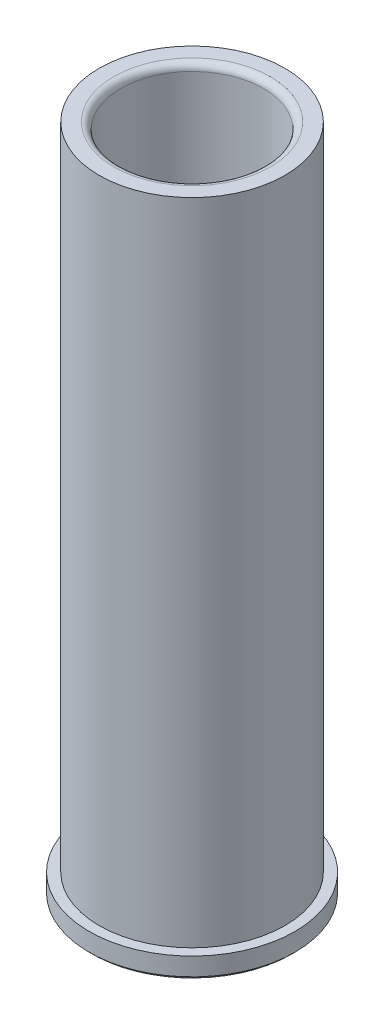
ISO-10303-21;
HEADER;
FILE_DESCRIPTION(('STEP AP214'),'2;1');
FILE_NAME('part.step','',(''),(''),'','','');
FILE_SCHEMA(('AUTOMOTIVE_DESIGN { 1 0 10303 214 1 1 1 1 }'));
ENDSEC;
DATA;
#1=APPLICATION_CONTEXT('core data for automotive mechanical design processes');
#2=APPLICATION_PROTOCOL_DEFINITION('international standard','automotive_design',2000,#1);
#3=PRODUCT_CONTEXT('',#1,'mechanical');
#4=PRODUCT('Part','Part','',(#3));
#5=PRODUCT_RELATED_PRODUCT_CATEGORY('part','',(#4));
#6=PRODUCT_DEFINITION_FORMATION('','',#4);
#7=PRODUCT_DEFINITION_CONTEXT('part definition',#1,'design');
#8=PRODUCT_DEFINITION('design','',#6,#7);
#9=PRODUCT_DEFINITION_SHAPE('','',#8);
#10=(LENGTH_UNIT() NAMED_UNIT(*) SI_UNIT(.MILLI.,.METRE.));
#11=(NAMED_UNIT(*) PLANE_ANGLE_UNIT() SI_UNIT($,.RADIAN.));
#12=(NAMED_UNIT(*) SI_UNIT($,.STERADIAN.) SOLID_ANGLE_UNIT());
#13=UNCERTAINTY_MEASURE_WITH_UNIT(LENGTH_MEASURE(1.E-05),#10,'distance_accuracy_value','');
#14=(GEOMETRIC_REPRESENTATION_CONTEXT(3) GLOBAL_UNCERTAINTY_ASSIGNED_CONTEXT((#13)) GLOBAL_UNIT_ASSIGNED_CONTEXT((#10,
#11,#12)) REPRESENTATION_CONTEXT('',''));
#15=CARTESIAN_POINT('',(0.,0.,0.));
#16=DIRECTION('',(0.,0.,1.));
#17=DIRECTION('',(1.,0.,0.));
#18=AXIS2_PLACEMENT_3D('',#15,#16,#17);
#19=CARTESIAN_POINT('',(3.49148336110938E-12,-1000.,0.));
#20=DIRECTION('',(0.,-1.,0.));
#21=DIRECTION('',(1.,0.,0.));
#22=AXIS2_PLACEMENT_3D('',#19,#20,#21);
#23=CYLINDRICAL_SURFACE('',#22,20.6438499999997);
#24=CARTESIAN_POINT('',(0.,4.7625,0.));
#25=DIRECTION('',(0.,-1.,0.));
#26=DIRECTION('',(1.,0.,0.));
#27=AXIS2_PLACEMENT_3D('',#24,#25,#26);
#28=CIRCLE('',#27,20.64385);
#29=CARTESIAN_POINT('',(20.6438499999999,4.76250000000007,0.));
#30=VERTEX_POINT('',#29);
#31=EDGE_CURVE('E60',#30,#30,#28,.T.);
#32=ORIENTED_EDGE('',*,*,#31,.F.);
#33=EDGE_LOOP('',(#32));
#34=FACE_BOUND('',#33,.T.);
#35=CARTESIAN_POINT('',(-5.21016604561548E-13,149.225,0.));
#36=DIRECTION('',(0.,-1.,0.));
#37=DIRECTION('',(1.,0.,0.));
#38=AXIS2_PLACEMENT_3D('',#35,#36,#37);
#39=CIRCLE('',#38,20.6438499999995);
#40=CARTESIAN_POINT('',(20.643849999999,149.225,0.));
#41=VERTEX_POINT('',#40);
#42=EDGE_CURVE('E39',#41,#41,#39,.T.);
#43=ORIENTED_EDGE('',*,*,#42,.T.);
#44=EDGE_LOOP('',(#43));
#45=FACE_BOUND('',#44,.T.);
#46=ADVANCED_FACE('F28',(#34,#45),#23,.T.);
#47=CARTESIAN_POINT('',(-20.64385,149.225,0.));
#48=DIRECTION('',(0.,-1.,0.));
#49=DIRECTION('',(1.,0.,0.));
#50=AXIS2_PLACEMENT_3D('',#47,#48,#49);
#51=PLANE('',#50);
#52=CARTESIAN_POINT('',(-5.21016604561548E-13,149.225,0.));
#53=DIRECTION('',(0.,-1.,0.));
#54=DIRECTION('',(1.,0.,0.));
#55=AXIS2_PLACEMENT_3D('',#52,#53,#54);
#56=CIRCLE('',#55,17.4053499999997);
#57=CARTESIAN_POINT('',(17.4053499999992,149.225,0.));
#58=VERTEX_POINT('',#57);
#59=EDGE_CURVE('E35',#58,#58,#56,.T.);
#60=ORIENTED_EDGE('',*,*,#59,.T.);
#61=EDGE_LOOP('',(#60));
#62=FACE_BOUND('',#61,.T.);
#63=ORIENTED_EDGE('',*,*,#42,.F.);
#64=EDGE_LOOP('',(#63));
#65=FACE_BOUND('',#64,.T.);
#66=ADVANCED_FACE('F68',(#62,#65),#51,.F.);
#67=CARTESIAN_POINT('',(3.49148336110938E-12,-1000.,0.));
#68=DIRECTION('',(0.,-1.,0.));
#69=DIRECTION('',(1.,0.,0.));
#70=AXIS2_PLACEMENT_3D('',#67,#68,#69);
#71=CYLINDRICAL_SURFACE('',#70,15.8813499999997);
#72=CARTESIAN_POINT('',(-5.15695583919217E-13,147.701,0.));
#73=DIRECTION('',(0.,-1.,0.));
#74=DIRECTION('',(1.,0.,0.));
#75=AXIS2_PLACEMENT_3D('',#72,#73,#74);
#76=CIRCLE('',#75,15.8813499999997);
#77=CARTESIAN_POINT('',(15.8813499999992,147.701,0.));
#78=VERTEX_POINT('',#77);
#79=EDGE_CURVE('E10',#78,#78,#76,.F.);
#80=ORIENTED_EDGE('',*,*,#79,.T.);
#81=EDGE_LOOP('',(#80));
#82=FACE_BOUND('',#81,.T.);
#83=CARTESIAN_POINT('',(0.,0.761999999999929,0.));
#84=DIRECTION('',(0.,-1.,0.));
#85=DIRECTION('',(1.,0.,0.));
#86=AXIS2_PLACEMENT_3D('',#83,#84,#85);
#87=CIRCLE('',#86,15.88135);
#88=CARTESIAN_POINT('',(15.88135,0.761999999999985,0.));
#89=VERTEX_POINT('',#88);
#90=EDGE_CURVE('E43',#89,#89,#87,.T.);
#91=ORIENTED_EDGE('',*,*,#90,.T.);
#92=EDGE_LOOP('',(#91));
#93=FACE_BOUND('',#92,.T.);
#94=ADVANCED_FACE('F72',(#82,#93),#71,.F.);
#95=CARTESIAN_POINT('',(0.,0.,0.));
#96=DIRECTION('',(0.,-1.,0.));
#97=DIRECTION('',(1.,0.,0.));
#98=AXIS2_PLACEMENT_3D('',#95,#96,#97);
#99=CONICAL_SURFACE('',#98,16.64335,0.785398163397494);
#100=ORIENTED_EDGE('',*,*,#90,.F.);
#101=EDGE_LOOP('',(#100));
#102=FACE_BOUND('',#101,.T.);
#103=CARTESIAN_POINT('',(0.,0.,0.));
#104=DIRECTION('',(0.,-1.,0.));
#105=DIRECTION('',(1.,0.,0.));
#106=AXIS2_PLACEMENT_3D('',#103,#104,#105);
#107=CIRCLE('',#106,16.64335);
#108=CARTESIAN_POINT('',(16.64335,0.,0.));
#109=VERTEX_POINT('',#108);
#110=EDGE_CURVE('E48',#109,#109,#107,.T.);
#111=ORIENTED_EDGE('',*,*,#110,.T.);
#112=EDGE_LOOP('',(#111));
#113=FACE_BOUND('',#112,.T.);
#114=ADVANCED_FACE('F77',(#102,#113),#99,.F.);
#115=CARTESIAN_POINT('',(-16.64335,0.,0.));
#116=DIRECTION('',(0.,1.,0.));
#117=DIRECTION('',(-1.,0.,0.));
#118=AXIS2_PLACEMENT_3D('',#115,#116,#117);
#119=PLANE('',#118);
#120=ORIENTED_EDGE('',*,*,#110,.F.);
#121=EDGE_LOOP('',(#120));
#122=FACE_BOUND('',#121,.T.);
#123=CARTESIAN_POINT('',(0.,0.,0.));
#124=DIRECTION('',(0.,-1.,0.));
#125=DIRECTION('',(1.,0.,0.));
#126=AXIS2_PLACEMENT_3D('',#123,#124,#125);
#127=CIRCLE('',#126,22.1234);
#128=CARTESIAN_POINT('',(22.1234,0.,0.));
#129=VERTEX_POINT('',#128);
#130=EDGE_CURVE('E51',#129,#129,#127,.T.);
#131=ORIENTED_EDGE('',*,*,#130,.T.);
#132=EDGE_LOOP('',(#131));
#133=FACE_BOUND('',#132,.T.);
#134=ADVANCED_FACE('F82',(#122,#133),#119,.F.);
#135=CARTESIAN_POINT('',(0.,0.761999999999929,0.));
#136=DIRECTION('',(0.,1.,0.));
#137=DIRECTION('',(-1.,0.,0.));
#138=AXIS2_PLACEMENT_3D('',#135,#136,#137);
#139=CONICAL_SURFACE('',#138,22.8854,0.785398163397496);
#140=ORIENTED_EDGE('',*,*,#130,.F.);
#141=EDGE_LOOP('',(#140));
#142=FACE_BOUND('',#141,.T.);
#143=CARTESIAN_POINT('',(0.,0.761999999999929,0.));
#144=DIRECTION('',(0.,-1.,0.));
#145=DIRECTION('',(1.,0.,0.));
#146=AXIS2_PLACEMENT_3D('',#143,#144,#145);
#147=CIRCLE('',#146,22.8854);
#148=CARTESIAN_POINT('',(22.8854,0.762000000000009,0.));
#149=VERTEX_POINT('',#148);
#150=EDGE_CURVE('E54',#149,#149,#147,.T.);
#151=ORIENTED_EDGE('',*,*,#150,.T.);
#152=EDGE_LOOP('',(#151));
#153=FACE_BOUND('',#152,.T.);
#154=ADVANCED_FACE('F86',(#142,#153),#139,.T.);
#155=CARTESIAN_POINT('',(3.49148336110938E-12,-1000.,0.));
#156=DIRECTION('',(0.,-1.,0.));
#157=DIRECTION('',(1.,0.,0.));
#158=AXIS2_PLACEMENT_3D('',#155,#156,#157);
#159=CYLINDRICAL_SURFACE('',#158,22.8854);
#160=ORIENTED_EDGE('',*,*,#150,.F.);
#161=EDGE_LOOP('',(#160));
#162=FACE_BOUND('',#161,.T.);
#163=CARTESIAN_POINT('',(0.,4.7625,0.));
#164=DIRECTION('',(0.,-1.,0.));
#165=DIRECTION('',(1.,0.,0.));
#166=AXIS2_PLACEMENT_3D('',#163,#164,#165);
#167=CIRCLE('',#166,22.8854);
#168=CARTESIAN_POINT('',(22.8854,4.76250000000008,0.));
#169=VERTEX_POINT('',#168);
#170=EDGE_CURVE('E57',#169,#169,#167,.T.);
#171=ORIENTED_EDGE('',*,*,#170,.T.);
#172=EDGE_LOOP('',(#171));
#173=FACE_BOUND('',#172,.T.);
#174=ADVANCED_FACE('F90',(#162,#173),#159,.T.);
#175=CARTESIAN_POINT('',(-22.8854,4.76249999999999,0.));
#176=DIRECTION('',(0.,-1.,0.));
#177=DIRECTION('',(1.,0.,0.));
#178=AXIS2_PLACEMENT_3D('',#175,#176,#177);
#179=PLANE('',#178);
#180=ORIENTED_EDGE('',*,*,#170,.F.);
#181=EDGE_LOOP('',(#180));
#182=FACE_BOUND('',#181,.T.);
#183=ORIENTED_EDGE('',*,*,#31,.T.);
#184=EDGE_LOOP('',(#183));
#185=FACE_BOUND('',#184,.T.);
#186=ADVANCED_FACE('F64',(#182,#185),#179,.F.);
#187=CARTESIAN_POINT('',(-5.15695583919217E-13,147.701,0.));
#188=DIRECTION('',(0.,-1.,0.));
#189=DIRECTION('',(1.,0.,0.));
#190=AXIS2_PLACEMENT_3D('',#187,#188,#189);
#191=TOROIDAL_SURFACE('',#190,17.4053499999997,1.524);
#192=ORIENTED_EDGE('',*,*,#79,.F.);
#193=EDGE_LOOP('',(#192));
#194=FACE_BOUND('',#193,.T.);
#195=ORIENTED_EDGE('',*,*,#59,.F.);
#196=EDGE_LOOP('',(#195));
#197=FACE_BOUND('',#196,.T.);
#198=ADVANCED_FACE('F30',(#194,#197),#191,.T.);
#199=CLOSED_SHELL('',(#46,#66,#94,#114,#134,#154,#174,#186,#198));
#200=MANIFOLD_SOLID_BREP('B2',#199);
#201=ADVANCED_BREP_SHAPE_REPRESENTATION('',(#18,#200),#14);
#202=SHAPE_DEFINITION_REPRESENTATION(#9,#201);
ENDSEC;
END-ISO-10303-21;
